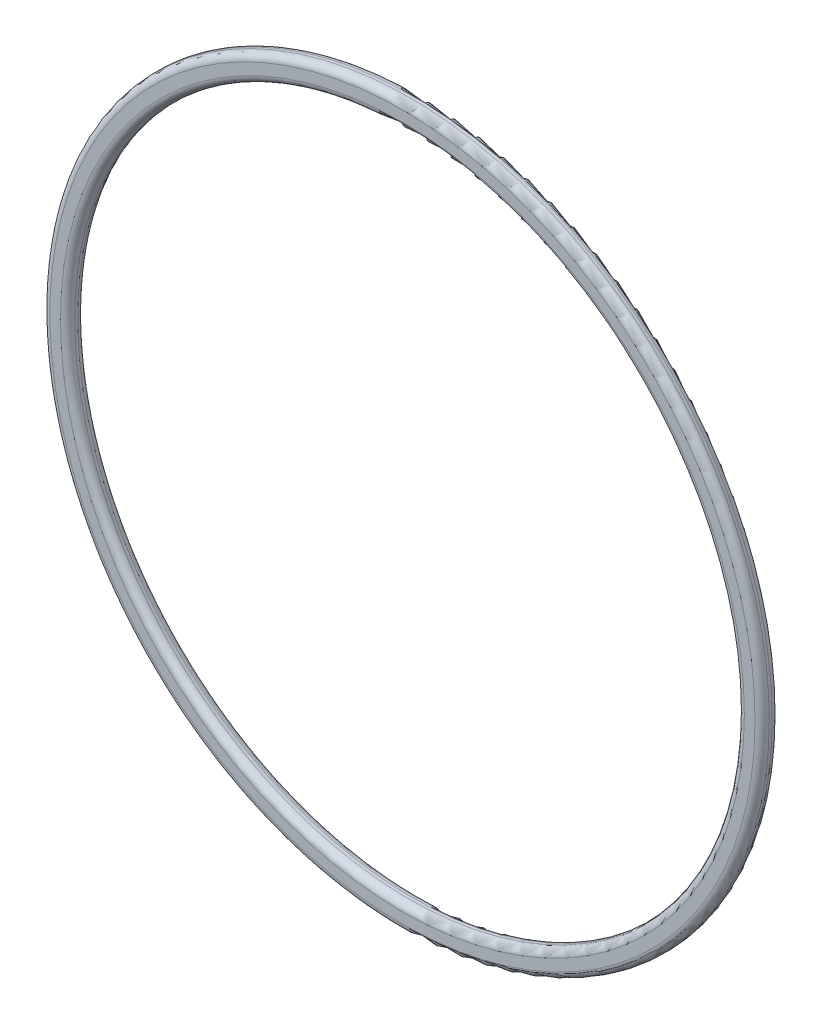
from build123d import *


with BuildPart() as part:
    # Esquisse1 → R_volution1 (revolve)
    with BuildSketch(Plane(origin=(0, 0, 0), x_dir=(0, 0, -1), z_dir=(1, 0, 0)), mode=Mode.PRIVATE) as r_volution1_sk:
        with BuildLine():
            Line((1.459361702, 50.5), (1.859361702, 50.5))
            ThreePointArc((1.859361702, 50.5), (2.566468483, 50.207106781), (2.859361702, 49.5))
            Line((2.859361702, 49.5), (2.859361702, 48))
            ThreePointArc((2.859361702, 48), (2.566468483, 47.292893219), (1.859361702, 47))
            Line((1.859361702, 47), (1.459361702, 47))
            ThreePointArc((1.459361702, 47), (0.752254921, 47.292893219), (0.459361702, 48))
            Line((0.459361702, 48), (0.459361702, 49.5))
            ThreePointArc((0.459361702, 49.5), (0.752254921, 50.207106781), (1.459361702, 50.5))
        make_face()
    revolve(r_volution1_sk.sketch.rotate(Axis((0, 0, 20.824397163), (0, 0, -1)), 90), axis=Axis((0, 0, 20.824397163), (0, 0, -1)))


solid = part.part
